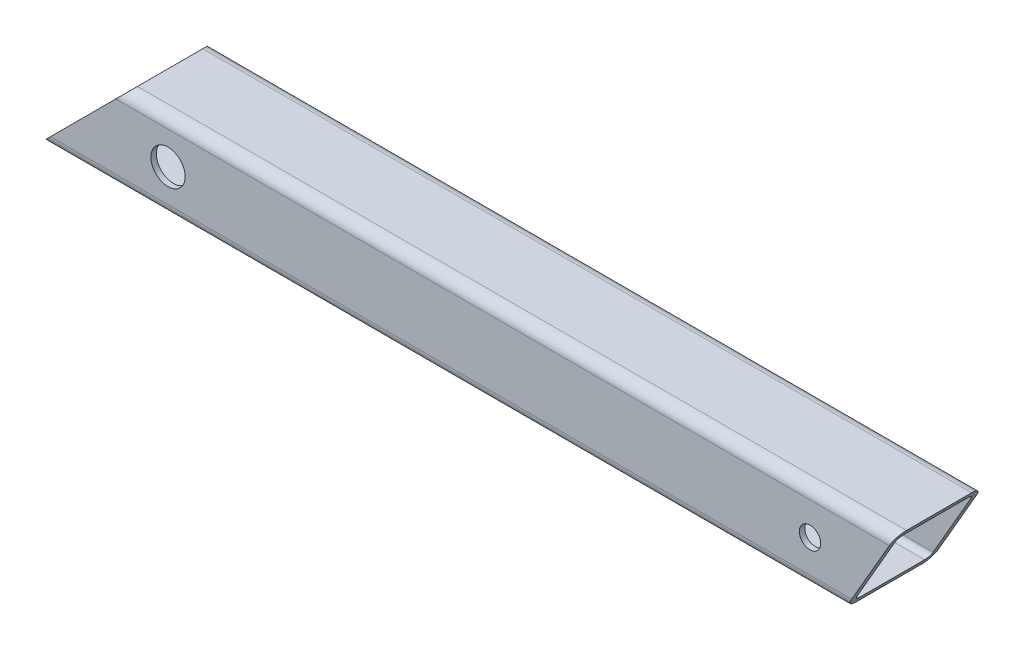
ISO-10303-21;
HEADER;
FILE_DESCRIPTION(('STEP AP214'),'2;1');
FILE_NAME('part.step','',(''),(''),'','','');
FILE_SCHEMA(('AUTOMOTIVE_DESIGN { 1 0 10303 214 1 1 1 1 }'));
ENDSEC;
DATA;
#1=APPLICATION_CONTEXT('core data for automotive mechanical design processes');
#2=APPLICATION_PROTOCOL_DEFINITION('international standard','automotive_design',2000,#1);
#3=PRODUCT_CONTEXT('',#1,'mechanical');
#4=PRODUCT('Part','Part','',(#3));
#5=PRODUCT_RELATED_PRODUCT_CATEGORY('part','',(#4));
#6=PRODUCT_DEFINITION_FORMATION('','',#4);
#7=PRODUCT_DEFINITION_CONTEXT('part definition',#1,'design');
#8=PRODUCT_DEFINITION('design','',#6,#7);
#9=PRODUCT_DEFINITION_SHAPE('','',#8);
#10=(LENGTH_UNIT() NAMED_UNIT(*) SI_UNIT(.MILLI.,.METRE.));
#11=(NAMED_UNIT(*) PLANE_ANGLE_UNIT() SI_UNIT($,.RADIAN.));
#12=(NAMED_UNIT(*) SI_UNIT($,.STERADIAN.) SOLID_ANGLE_UNIT());
#13=UNCERTAINTY_MEASURE_WITH_UNIT(LENGTH_MEASURE(1.E-05),#10,'distance_accuracy_value','');
#14=(GEOMETRIC_REPRESENTATION_CONTEXT(3) GLOBAL_UNCERTAINTY_ASSIGNED_CONTEXT((#13)) GLOBAL_UNIT_ASSIGNED_CONTEXT((#10,
#11,#12)) REPRESENTATION_CONTEXT('',''));
#15=CARTESIAN_POINT('',(0.,0.,0.));
#16=DIRECTION('',(0.,0.,1.));
#17=DIRECTION('',(1.,0.,0.));
#18=AXIS2_PLACEMENT_3D('',#15,#16,#17);
#19=CARTESIAN_POINT('',(1000.,38.1,38.0999999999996));
#20=DIRECTION('',(-1.,0.,0.));
#21=DIRECTION('',(0.,0.,1.));
#22=AXIS2_PLACEMENT_3D('',#19,#20,#21);
#23=CYLINDRICAL_SURFACE('',#22,6.34999999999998);
#24=DIRECTION('',(-1.,0.,0.));
#25=VECTOR('',#24,1.);
#26=CARTESIAN_POINT('',(1000.,44.45,38.0999999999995));
#27=LINE('',#26,#25);
#28=CARTESIAN_POINT('',(996.333825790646,44.45,38.0999999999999));
#29=VERTEX_POINT('',#28);
#30=CARTESIAN_POINT('',(95.2499999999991,44.45,38.1));
#31=VERTEX_POINT('',#30);
#32=EDGE_CURVE('E12',#29,#31,#27,.T.);
#33=ORIENTED_EDGE('',*,*,#32,.F.);
#34=CARTESIAN_POINT('',(992.667651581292,38.1,38.0999999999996));
#35=DIRECTION('',(0.866025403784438,-0.500000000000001,0.));
#36=DIRECTION('',(-0.500000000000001,-0.866025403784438,0.));
#37=AXIS2_PLACEMENT_3D('',#34,#35,#36);
#38=ELLIPSE('',#37,7.33234841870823,6.34999999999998);
#39=CARTESIAN_POINT('',(992.667651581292,38.1,44.4499999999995));
#40=VERTEX_POINT('',#39);
#41=EDGE_CURVE('E276',#29,#40,#38,.T.);
#42=ORIENTED_EDGE('',*,*,#41,.T.);
#43=DIRECTION('',(-1.,0.,0.));
#44=VECTOR('',#43,1.);
#45=CARTESIAN_POINT('',(1000.,38.1,44.4499999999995));
#46=LINE('',#45,#44);
#47=CARTESIAN_POINT('',(88.8999999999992,38.1,44.4499999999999));
#48=VERTEX_POINT('',#47);
#49=EDGE_CURVE('E212',#40,#48,#46,.T.);
#50=ORIENTED_EDGE('',*,*,#49,.T.);
#51=CARTESIAN_POINT('',(88.8999999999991,38.1,38.1));
#52=DIRECTION('',(-0.707106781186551,0.707106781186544,0.));
#53=DIRECTION('',(-0.707106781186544,-0.707106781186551,0.));
#54=AXIS2_PLACEMENT_3D('',#51,#52,#53);
#55=ELLIPSE('',#54,8.98025612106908,6.34999999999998);
#56=EDGE_CURVE('E309',#48,#31,#55,.T.);
#57=ORIENTED_EDGE('',*,*,#56,.T.);
#58=EDGE_LOOP('',(#33,#42,#50,#57));
#59=FACE_BOUND('',#58,.T.);
#60=ADVANCED_FACE('F64',(#59),#23,.F.);
#61=CARTESIAN_POINT('',(1000.,44.45,38.0999999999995));
#62=DIRECTION('',(0.,-1.,0.));
#63=DIRECTION('',(0.,0.,-1.));
#64=AXIS2_PLACEMENT_3D('',#61,#62,#63);
#65=PLANE('',#64);
#66=DIRECTION('',(-1.,0.,0.));
#67=VECTOR('',#66,1.);
#68=CARTESIAN_POINT('',(1000.,44.45,-38.1000000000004));
#69=LINE('',#68,#67);
#70=CARTESIAN_POINT('',(996.333825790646,44.45,-38.1000000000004));
#71=VERTEX_POINT('',#70);
#72=CARTESIAN_POINT('',(95.2499999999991,44.45,-38.1));
#73=VERTEX_POINT('',#72);
#74=EDGE_CURVE('E73',#71,#73,#69,.T.);
#75=ORIENTED_EDGE('',*,*,#74,.F.);
#76=DIRECTION('',(0.,0.,1.));
#77=VECTOR('',#76,1.);
#78=CARTESIAN_POINT('',(996.333825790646,44.45,38.0999999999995));
#79=LINE('',#78,#77);
#80=EDGE_CURVE('E273',#71,#29,#79,.T.);
#81=ORIENTED_EDGE('',*,*,#80,.T.);
#82=ORIENTED_EDGE('',*,*,#32,.T.);
#83=DIRECTION('',(0.,0.,-1.));
#84=VECTOR('',#83,1.);
#85=CARTESIAN_POINT('',(95.2499999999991,44.45,38.0999999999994));
#86=LINE('',#85,#84);
#87=EDGE_CURVE('E306',#31,#73,#86,.T.);
#88=ORIENTED_EDGE('',*,*,#87,.T.);
#89=EDGE_LOOP('',(#75,#81,#82,#88));
#90=FACE_BOUND('',#89,.T.);
#91=ADVANCED_FACE('F357',(#90),#65,.T.);
#92=CARTESIAN_POINT('',(1000.,38.1,-38.1000000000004));
#93=DIRECTION('',(-1.,0.,0.));
#94=DIRECTION('',(0.,0.,1.));
#95=AXIS2_PLACEMENT_3D('',#92,#93,#94);
#96=CYLINDRICAL_SURFACE('',#95,6.34999999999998);
#97=DIRECTION('',(-1.,0.,0.));
#98=VECTOR('',#97,1.);
#99=CARTESIAN_POINT('',(1000.,38.1,-44.4500000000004));
#100=LINE('',#99,#98);
#101=CARTESIAN_POINT('',(992.667651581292,38.1,-44.4500000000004));
#102=VERTEX_POINT('',#101);
#103=CARTESIAN_POINT('',(88.8999999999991,38.1,-44.45));
#104=VERTEX_POINT('',#103);
#105=EDGE_CURVE('E222',#102,#104,#100,.T.);
#106=ORIENTED_EDGE('',*,*,#105,.F.);
#107=CARTESIAN_POINT('',(992.667651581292,38.1,-38.1000000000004));
#108=DIRECTION('',(0.866025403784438,-0.500000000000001,0.));
#109=DIRECTION('',(-0.500000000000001,-0.866025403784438,0.));
#110=AXIS2_PLACEMENT_3D('',#107,#108,#109);
#111=ELLIPSE('',#110,7.33234841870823,6.34999999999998);
#112=EDGE_CURVE('E270',#102,#71,#111,.T.);
#113=ORIENTED_EDGE('',*,*,#112,.T.);
#114=ORIENTED_EDGE('',*,*,#74,.T.);
#115=CARTESIAN_POINT('',(88.8999999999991,38.1,-38.1));
#116=DIRECTION('',(-0.707106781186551,0.707106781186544,0.));
#117=DIRECTION('',(-0.707106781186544,-0.707106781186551,0.));
#118=AXIS2_PLACEMENT_3D('',#115,#116,#117);
#119=ELLIPSE('',#118,8.98025612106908,6.34999999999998);
#120=EDGE_CURVE('E303',#73,#104,#119,.T.);
#121=ORIENTED_EDGE('',*,*,#120,.T.);
#122=EDGE_LOOP('',(#106,#113,#114,#121));
#123=FACE_BOUND('',#122,.T.);
#124=ADVANCED_FACE('F363',(#123),#96,.F.);
#125=CARTESIAN_POINT('',(1000.,38.1,-44.4500000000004));
#126=DIRECTION('',(0.,0.,1.));
#127=DIRECTION('',(1.,0.,0.));
#128=AXIS2_PLACEMENT_3D('',#125,#126,#127);
#129=PLANE('',#128);
#130=CARTESIAN_POINT('',(900.,0.,-44.4500000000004));
#131=DIRECTION('',(0.,0.,1.));
#132=DIRECTION('',(1.,0.,0.));
#133=AXIS2_PLACEMENT_3D('',#130,#131,#132);
#134=CIRCLE('',#133,12.5);
#135=CARTESIAN_POINT('',(912.5,0.,-44.4500000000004));
#136=VERTEX_POINT('',#135);
#137=EDGE_CURVE('E248',#136,#136,#134,.T.);
#138=ORIENTED_EDGE('',*,*,#137,.F.);
#139=EDGE_LOOP('',(#138));
#140=FACE_BOUND('',#139,.T.);
#141=CARTESIAN_POINT('',(150.,0.,-44.45));
#142=DIRECTION('',(0.,0.,1.));
#143=DIRECTION('',(1.,0.,0.));
#144=AXIS2_PLACEMENT_3D('',#141,#142,#143);
#145=CIRCLE('',#144,20.);
#146=CARTESIAN_POINT('',(170.,0.,-44.45));
#147=VERTEX_POINT('',#146);
#148=EDGE_CURVE('E235',#147,#147,#145,.T.);
#149=ORIENTED_EDGE('',*,*,#148,.F.);
#150=EDGE_LOOP('',(#149));
#151=FACE_BOUND('',#150,.T.);
#152=DIRECTION('',(-1.,0.,0.));
#153=VECTOR('',#152,1.);
#154=CARTESIAN_POINT('',(1000.,-38.1,-44.4500000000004));
#155=LINE('',#154,#153);
#156=CARTESIAN_POINT('',(948.673561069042,-38.1,-44.4500000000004));
#157=VERTEX_POINT('',#156);
#158=CARTESIAN_POINT('',(12.6999999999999,-38.1,-44.45));
#159=VERTEX_POINT('',#158);
#160=EDGE_CURVE('E220',#157,#159,#155,.T.);
#161=ORIENTED_EDGE('',*,*,#160,.F.);
#162=DIRECTION('',(0.500000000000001,0.866025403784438,0.));
#163=VECTOR('',#162,1.);
#164=CARTESIAN_POINT('',(994.500738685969,41.275,-44.4500000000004));
#165=LINE('',#164,#163);
#166=EDGE_CURVE('E267',#157,#102,#165,.T.);
#167=ORIENTED_EDGE('',*,*,#166,.T.);
#168=ORIENTED_EDGE('',*,*,#105,.T.);
#169=DIRECTION('',(-0.707106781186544,-0.707106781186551,0.));
#170=VECTOR('',#169,1.);
#171=CARTESIAN_POINT('',(544.449999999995,493.650000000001,-44.45));
#172=LINE('',#171,#170);
#173=EDGE_CURVE('E300',#104,#159,#172,.T.);
#174=ORIENTED_EDGE('',*,*,#173,.T.);
#175=EDGE_LOOP('',(#161,#167,#168,#174));
#176=FACE_BOUND('',#175,.T.);
#177=ADVANCED_FACE('F400',(#140,#151,#176),#129,.T.);
#178=CARTESIAN_POINT('',(1000.,-38.1,-38.1000000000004));
#179=DIRECTION('',(-1.,0.,0.));
#180=DIRECTION('',(0.,0.,1.));
#181=AXIS2_PLACEMENT_3D('',#178,#179,#180);
#182=CYLINDRICAL_SURFACE('',#181,6.35);
#183=DIRECTION('',(-1.,0.,0.));
#184=VECTOR('',#183,1.);
#185=CARTESIAN_POINT('',(1000.,-44.45,-38.1000000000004));
#186=LINE('',#185,#184);
#187=CARTESIAN_POINT('',(945.007386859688,-44.45,-38.1000000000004));
#188=VERTEX_POINT('',#187);
#189=CARTESIAN_POINT('',(6.35000000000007,-44.45,-38.1000000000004));
#190=VERTEX_POINT('',#189);
#191=EDGE_CURVE('E218',#188,#190,#186,.T.);
#192=ORIENTED_EDGE('',*,*,#191,.F.);
#193=CARTESIAN_POINT('',(948.673561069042,-38.1,-38.1000000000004));
#194=DIRECTION('',(0.866025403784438,-0.500000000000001,0.));
#195=DIRECTION('',(-0.500000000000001,-0.866025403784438,0.));
#196=AXIS2_PLACEMENT_3D('',#193,#194,#195);
#197=ELLIPSE('',#196,7.33234841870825,6.35);
#198=EDGE_CURVE('E264',#188,#157,#197,.T.);
#199=ORIENTED_EDGE('',*,*,#198,.T.);
#200=ORIENTED_EDGE('',*,*,#160,.T.);
#201=CARTESIAN_POINT('',(12.6999999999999,-38.1,-38.1));
#202=DIRECTION('',(-0.707106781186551,0.707106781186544,0.));
#203=DIRECTION('',(-0.707106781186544,-0.707106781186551,0.));
#204=AXIS2_PLACEMENT_3D('',#201,#202,#203);
#205=ELLIPSE('',#204,8.9802561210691,6.35);
#206=EDGE_CURVE('E297',#159,#190,#205,.T.);
#207=ORIENTED_EDGE('',*,*,#206,.T.);
#208=EDGE_LOOP('',(#192,#199,#200,#207));
#209=FACE_BOUND('',#208,.T.);
#210=ADVANCED_FACE('F396',(#209),#182,.F.);
#211=CARTESIAN_POINT('',(1000.,-44.45,38.0999999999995));
#212=DIRECTION('',(0.,1.,0.));
#213=DIRECTION('',(0.,0.,1.));
#214=AXIS2_PLACEMENT_3D('',#211,#212,#213);
#215=PLANE('',#214);
#216=DIRECTION('',(-1.,0.,0.));
#217=VECTOR('',#216,1.);
#218=CARTESIAN_POINT('',(1000.,-44.45,38.0999999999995));
#219=LINE('',#218,#217);
#220=CARTESIAN_POINT('',(945.007386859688,-44.45,38.0999999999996));
#221=VERTEX_POINT('',#220);
#222=CARTESIAN_POINT('',(6.35000000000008,-44.45,38.1));
#223=VERTEX_POINT('',#222);
#224=EDGE_CURVE('E216',#221,#223,#219,.T.);
#225=ORIENTED_EDGE('',*,*,#224,.F.);
#226=DIRECTION('',(0.,0.,-1.));
#227=VECTOR('',#226,1.);
#228=CARTESIAN_POINT('',(945.007386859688,-44.45,38.0999999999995));
#229=LINE('',#228,#227);
#230=EDGE_CURVE('E261',#221,#188,#229,.T.);
#231=ORIENTED_EDGE('',*,*,#230,.T.);
#232=ORIENTED_EDGE('',*,*,#191,.T.);
#233=DIRECTION('',(0.,0.,1.));
#234=VECTOR('',#233,1.);
#235=CARTESIAN_POINT('',(6.35000000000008,-44.45,38.0999999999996));
#236=LINE('',#235,#234);
#237=EDGE_CURVE('E294',#190,#223,#236,.T.);
#238=ORIENTED_EDGE('',*,*,#237,.T.);
#239=EDGE_LOOP('',(#225,#231,#232,#238));
#240=FACE_BOUND('',#239,.T.);
#241=ADVANCED_FACE('F392',(#240),#215,.T.);
#242=CARTESIAN_POINT('',(1000.,-38.1,38.0999999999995));
#243=DIRECTION('',(-1.,0.,0.));
#244=DIRECTION('',(0.,0.,1.));
#245=AXIS2_PLACEMENT_3D('',#242,#243,#244);
#246=CYLINDRICAL_SURFACE('',#245,6.34999999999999);
#247=DIRECTION('',(-1.,0.,0.));
#248=VECTOR('',#247,1.);
#249=CARTESIAN_POINT('',(1000.,-38.1,44.4499999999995));
#250=LINE('',#249,#248);
#251=CARTESIAN_POINT('',(948.673561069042,-38.1,44.4499999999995));
#252=VERTEX_POINT('',#251);
#253=CARTESIAN_POINT('',(12.6999999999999,-38.0999999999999,44.4499999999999));
#254=VERTEX_POINT('',#253);
#255=EDGE_CURVE('E214',#252,#254,#250,.T.);
#256=ORIENTED_EDGE('',*,*,#255,.F.);
#257=CARTESIAN_POINT('',(948.673561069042,-38.1,38.0999999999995));
#258=DIRECTION('',(0.866025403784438,-0.500000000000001,0.));
#259=DIRECTION('',(-0.500000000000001,-0.866025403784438,0.));
#260=AXIS2_PLACEMENT_3D('',#257,#258,#259);
#261=ELLIPSE('',#260,7.33234841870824,6.34999999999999);
#262=EDGE_CURVE('E258',#252,#221,#261,.T.);
#263=ORIENTED_EDGE('',*,*,#262,.T.);
#264=ORIENTED_EDGE('',*,*,#224,.T.);
#265=CARTESIAN_POINT('',(12.6999999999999,-38.1,38.1));
#266=DIRECTION('',(-0.707106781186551,0.707106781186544,0.));
#267=DIRECTION('',(-0.707106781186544,-0.707106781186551,0.));
#268=AXIS2_PLACEMENT_3D('',#265,#266,#267);
#269=ELLIPSE('',#268,8.98025612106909,6.34999999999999);
#270=EDGE_CURVE('E291',#223,#254,#269,.T.);
#271=ORIENTED_EDGE('',*,*,#270,.T.);
#272=EDGE_LOOP('',(#256,#263,#264,#271));
#273=FACE_BOUND('',#272,.T.);
#274=ADVANCED_FACE('F389',(#273),#246,.F.);
#275=CARTESIAN_POINT('',(1000.,38.1,-38.1000000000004));
#276=DIRECTION('',(-1.,0.,0.));
#277=DIRECTION('',(0.,0.,1.));
#278=AXIS2_PLACEMENT_3D('',#275,#276,#277);
#279=CYLINDRICAL_SURFACE('',#278,12.7);
#280=CARTESIAN_POINT('',(992.667651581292,38.1,-38.1000000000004));
#281=DIRECTION('',(0.866025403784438,-0.500000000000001,0.));
#282=DIRECTION('',(-0.500000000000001,-0.866025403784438,0.));
#283=AXIS2_PLACEMENT_3D('',#280,#281,#282);
#284=ELLIPSE('',#283,14.6646968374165,12.7);
#285=CARTESIAN_POINT('',(992.667651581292,38.1,-50.8000000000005));
#286=VERTEX_POINT('',#285);
#287=CARTESIAN_POINT('',(1000.,50.8,-38.1000000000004));
#288=VERTEX_POINT('',#287);
#289=EDGE_CURVE('E200',#286,#288,#284,.T.);
#290=ORIENTED_EDGE('',*,*,#289,.F.);
#291=DIRECTION('',(-1.,0.,0.));
#292=VECTOR('',#291,1.);
#293=CARTESIAN_POINT('',(1000.,38.1,-50.8000000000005));
#294=LINE('',#293,#292);
#295=CARTESIAN_POINT('',(88.8999999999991,38.1,-50.8000000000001));
#296=VERTEX_POINT('',#295);
#297=EDGE_CURVE('E201',#286,#296,#294,.T.);
#298=ORIENTED_EDGE('',*,*,#297,.T.);
#299=CARTESIAN_POINT('',(88.8999999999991,38.1,-38.1));
#300=DIRECTION('',(-0.707106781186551,0.707106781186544,0.));
#301=DIRECTION('',(-0.707106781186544,-0.707106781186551,0.));
#302=AXIS2_PLACEMENT_3D('',#299,#300,#301);
#303=ELLIPSE('',#302,17.9605122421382,12.7);
#304=CARTESIAN_POINT('',(101.599999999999,50.8,-38.1000000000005));
#305=VERTEX_POINT('',#304);
#306=EDGE_CURVE('E318',#305,#296,#303,.T.);
#307=ORIENTED_EDGE('',*,*,#306,.F.);
#308=DIRECTION('',(-1.,0.,0.));
#309=VECTOR('',#308,1.);
#310=CARTESIAN_POINT('',(1000.,50.8,-38.1000000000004));
#311=LINE('',#310,#309);
#312=EDGE_CURVE('E189',#288,#305,#311,.T.);
#313=ORIENTED_EDGE('',*,*,#312,.F.);
#314=EDGE_LOOP('',(#290,#298,#307,#313));
#315=FACE_BOUND('',#314,.T.);
#316=ADVANCED_FACE('F66',(#315),#279,.T.);
#317=CARTESIAN_POINT('',(1000.,38.1,38.0999999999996));
#318=DIRECTION('',(-1.,0.,0.));
#319=DIRECTION('',(0.,0.,1.));
#320=AXIS2_PLACEMENT_3D('',#317,#318,#319);
#321=CYLINDRICAL_SURFACE('',#320,12.7);
#322=CARTESIAN_POINT('',(992.667651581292,38.1,38.0999999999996));
#323=DIRECTION('',(0.866025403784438,-0.500000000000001,0.));
#324=DIRECTION('',(-0.500000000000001,-0.866025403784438,0.));
#325=AXIS2_PLACEMENT_3D('',#322,#323,#324);
#326=ELLIPSE('',#325,14.6646968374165,12.7);
#327=CARTESIAN_POINT('',(1000.,50.8,38.0999999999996));
#328=VERTEX_POINT('',#327);
#329=CARTESIAN_POINT('',(992.667651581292,38.1,50.7999999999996));
#330=VERTEX_POINT('',#329);
#331=EDGE_CURVE('E193',#328,#330,#326,.T.);
#332=ORIENTED_EDGE('',*,*,#331,.F.);
#333=DIRECTION('',(-1.,0.,0.));
#334=VECTOR('',#333,1.);
#335=CARTESIAN_POINT('',(1000.,50.8,38.0999999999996));
#336=LINE('',#335,#334);
#337=CARTESIAN_POINT('',(101.599999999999,50.8,38.0999999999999));
#338=VERTEX_POINT('',#337);
#339=EDGE_CURVE('E179',#328,#338,#336,.T.);
#340=ORIENTED_EDGE('',*,*,#339,.T.);
#341=CARTESIAN_POINT('',(88.8999999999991,38.1,38.1));
#342=DIRECTION('',(-0.707106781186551,0.707106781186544,0.));
#343=DIRECTION('',(-0.707106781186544,-0.707106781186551,0.));
#344=AXIS2_PLACEMENT_3D('',#341,#342,#343);
#345=ELLIPSE('',#344,17.9605122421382,12.7);
#346=CARTESIAN_POINT('',(88.8999999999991,38.1,50.8));
#347=VERTEX_POINT('',#346);
#348=EDGE_CURVE('E207',#347,#338,#345,.T.);
#349=ORIENTED_EDGE('',*,*,#348,.F.);
#350=DIRECTION('',(-1.,0.,0.));
#351=VECTOR('',#350,1.);
#352=CARTESIAN_POINT('',(1000.,38.1,50.7999999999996));
#353=LINE('',#352,#351);
#354=EDGE_CURVE('E190',#330,#347,#353,.T.);
#355=ORIENTED_EDGE('',*,*,#354,.F.);
#356=EDGE_LOOP('',(#332,#340,#349,#355));
#357=FACE_BOUND('',#356,.T.);
#358=ADVANCED_FACE('F194',(#357),#321,.T.);
#359=CARTESIAN_POINT('',(1000.,38.1,50.7999999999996));
#360=DIRECTION('',(0.,0.,-1.));
#361=DIRECTION('',(-1.,0.,0.));
#362=AXIS2_PLACEMENT_3D('',#359,#360,#361);
#363=PLANE('',#362);
#364=CARTESIAN_POINT('',(900.,0.,50.8));
#365=DIRECTION('',(0.,0.,1.));
#366=DIRECTION('',(1.,0.,0.));
#367=AXIS2_PLACEMENT_3D('',#364,#365,#366);
#368=CIRCLE('',#367,12.5);
#369=CARTESIAN_POINT('',(912.5,0.,50.8));
#370=VERTEX_POINT('',#369);
#371=EDGE_CURVE('E449',#370,#370,#368,.T.);
#372=ORIENTED_EDGE('',*,*,#371,.F.);
#373=EDGE_LOOP('',(#372));
#374=FACE_BOUND('',#373,.T.);
#375=CARTESIAN_POINT('',(150.,0.,50.8));
#376=DIRECTION('',(0.,0.,1.));
#377=DIRECTION('',(1.,0.,0.));
#378=AXIS2_PLACEMENT_3D('',#375,#376,#377);
#379=CIRCLE('',#378,20.);
#380=CARTESIAN_POINT('',(170.,0.,50.8));
#381=VERTEX_POINT('',#380);
#382=EDGE_CURVE('E243',#381,#381,#379,.T.);
#383=ORIENTED_EDGE('',*,*,#382,.F.);
#384=EDGE_LOOP('',(#383));
#385=FACE_BOUND('',#384,.T.);
#386=DIRECTION('',(-0.500000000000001,-0.866025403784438,0.));
#387=VECTOR('',#386,1.);
#388=CARTESIAN_POINT('',(994.500738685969,41.275,50.7999999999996));
#389=LINE('',#388,#387);
#390=CARTESIAN_POINT('',(948.673561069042,-38.1,50.7999999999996));
#391=VERTEX_POINT('',#390);
#392=EDGE_CURVE('E81',#330,#391,#389,.T.);
#393=ORIENTED_EDGE('',*,*,#392,.F.);
#394=ORIENTED_EDGE('',*,*,#354,.T.);
#395=DIRECTION('',(0.707106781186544,0.707106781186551,0.));
#396=VECTOR('',#395,1.);
#397=CARTESIAN_POINT('',(544.449999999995,493.650000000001,50.8));
#398=LINE('',#397,#396);
#399=CARTESIAN_POINT('',(12.6999999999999,-38.1,50.8));
#400=VERTEX_POINT('',#399);
#401=EDGE_CURVE('E323',#400,#347,#398,.T.);
#402=ORIENTED_EDGE('',*,*,#401,.F.);
#403=DIRECTION('',(-1.,0.,0.));
#404=VECTOR('',#403,1.);
#405=CARTESIAN_POINT('',(1000.,-38.1,50.7999999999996));
#406=LINE('',#405,#404);
#407=EDGE_CURVE('E230',#391,#400,#406,.T.);
#408=ORIENTED_EDGE('',*,*,#407,.F.);
#409=EDGE_LOOP('',(#393,#394,#402,#408));
#410=FACE_BOUND('',#409,.T.);
#411=ADVANCED_FACE('F344',(#374,#385,#410),#363,.F.);
#412=CARTESIAN_POINT('',(1000.,-38.1,38.0999999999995));
#413=DIRECTION('',(-1.,0.,0.));
#414=DIRECTION('',(0.,0.,1.));
#415=AXIS2_PLACEMENT_3D('',#412,#413,#414);
#416=CYLINDRICAL_SURFACE('',#415,12.7);
#417=CARTESIAN_POINT('',(948.673561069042,-38.1,38.0999999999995));
#418=DIRECTION('',(0.866025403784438,-0.500000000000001,0.));
#419=DIRECTION('',(-0.500000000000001,-0.866025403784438,0.));
#420=AXIS2_PLACEMENT_3D('',#417,#418,#419);
#421=ELLIPSE('',#420,14.6646968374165,12.7);
#422=CARTESIAN_POINT('',(941.341212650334,-50.8,38.0999999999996));
#423=VERTEX_POINT('',#422);
#424=EDGE_CURVE('E89',#391,#423,#421,.T.);
#425=ORIENTED_EDGE('',*,*,#424,.F.);
#426=ORIENTED_EDGE('',*,*,#407,.T.);
#427=CARTESIAN_POINT('',(12.6999999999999,-38.1,38.1));
#428=DIRECTION('',(-0.707106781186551,0.707106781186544,0.));
#429=DIRECTION('',(-0.707106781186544,-0.707106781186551,0.));
#430=AXIS2_PLACEMENT_3D('',#427,#428,#429);
#431=ELLIPSE('',#430,17.9605122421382,12.7);
#432=CARTESIAN_POINT('',(0.,-50.8,38.1));
#433=VERTEX_POINT('',#432);
#434=EDGE_CURVE('E321',#433,#400,#431,.T.);
#435=ORIENTED_EDGE('',*,*,#434,.F.);
#436=DIRECTION('',(-1.,0.,0.));
#437=VECTOR('',#436,1.);
#438=CARTESIAN_POINT('',(1000.,-50.8,38.0999999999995));
#439=LINE('',#438,#437);
#440=EDGE_CURVE('E228',#423,#433,#439,.T.);
#441=ORIENTED_EDGE('',*,*,#440,.F.);
#442=EDGE_LOOP('',(#425,#426,#435,#441));
#443=FACE_BOUND('',#442,.T.);
#444=ADVANCED_FACE('F343',(#443),#416,.T.);
#445=CARTESIAN_POINT('',(1000.,-38.1,-38.1000000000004));
#446=DIRECTION('',(-1.,0.,0.));
#447=DIRECTION('',(0.,0.,1.));
#448=AXIS2_PLACEMENT_3D('',#445,#446,#447);
#449=CYLINDRICAL_SURFACE('',#448,12.7);
#450=CARTESIAN_POINT('',(948.673561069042,-38.1,-38.1000000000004));
#451=DIRECTION('',(0.866025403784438,-0.500000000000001,0.));
#452=DIRECTION('',(-0.500000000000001,-0.866025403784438,0.));
#453=AXIS2_PLACEMENT_3D('',#450,#451,#452);
#454=ELLIPSE('',#453,14.6646968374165,12.7);
#455=CARTESIAN_POINT('',(941.341212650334,-50.8,-38.1000000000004));
#456=VERTEX_POINT('',#455);
#457=CARTESIAN_POINT('',(948.673561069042,-38.1,-50.8000000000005));
#458=VERTEX_POINT('',#457);
#459=EDGE_CURVE('E281',#456,#458,#454,.T.);
#460=ORIENTED_EDGE('',*,*,#459,.F.);
#461=DIRECTION('',(-1.,0.,0.));
#462=VECTOR('',#461,1.);
#463=CARTESIAN_POINT('',(1000.,-50.8,-38.1000000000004));
#464=LINE('',#463,#462);
#465=CARTESIAN_POINT('',(0.,-50.8,-38.1));
#466=VERTEX_POINT('',#465);
#467=EDGE_CURVE('E226',#456,#466,#464,.T.);
#468=ORIENTED_EDGE('',*,*,#467,.T.);
#469=CARTESIAN_POINT('',(12.6999999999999,-38.1,-38.1));
#470=DIRECTION('',(-0.707106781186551,0.707106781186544,0.));
#471=DIRECTION('',(-0.707106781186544,-0.707106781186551,0.));
#472=AXIS2_PLACEMENT_3D('',#469,#470,#471);
#473=ELLIPSE('',#472,17.9605122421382,12.7);
#474=CARTESIAN_POINT('',(12.6999999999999,-38.1,-50.8));
#475=VERTEX_POINT('',#474);
#476=EDGE_CURVE('E315',#475,#466,#473,.T.);
#477=ORIENTED_EDGE('',*,*,#476,.F.);
#478=DIRECTION('',(-1.,0.,0.));
#479=VECTOR('',#478,1.);
#480=CARTESIAN_POINT('',(1000.,-38.1,-50.8000000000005));
#481=LINE('',#480,#479);
#482=EDGE_CURVE('E204',#458,#475,#481,.T.);
#483=ORIENTED_EDGE('',*,*,#482,.F.);
#484=EDGE_LOOP('',(#460,#468,#477,#483));
#485=FACE_BOUND('',#484,.T.);
#486=ADVANCED_FACE('F337',(#485),#449,.T.);
#487=CARTESIAN_POINT('',(1000.,38.1,-50.8000000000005));
#488=DIRECTION('',(0.,0.,1.));
#489=DIRECTION('',(1.,0.,0.));
#490=AXIS2_PLACEMENT_3D('',#487,#488,#489);
#491=PLANE('',#490);
#492=CARTESIAN_POINT('',(900.,0.,-50.8000000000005));
#493=DIRECTION('',(0.,0.,1.));
#494=DIRECTION('',(1.,0.,0.));
#495=AXIS2_PLACEMENT_3D('',#492,#493,#494);
#496=CIRCLE('',#495,12.5);
#497=CARTESIAN_POINT('',(912.5,0.,-50.8000000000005));
#498=VERTEX_POINT('',#497);
#499=EDGE_CURVE('E450',#498,#498,#496,.T.);
#500=ORIENTED_EDGE('',*,*,#499,.T.);
#501=EDGE_LOOP('',(#500));
#502=FACE_BOUND('',#501,.T.);
#503=CARTESIAN_POINT('',(150.,0.,-50.8000000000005));
#504=DIRECTION('',(0.,0.,1.));
#505=DIRECTION('',(1.,0.,0.));
#506=AXIS2_PLACEMENT_3D('',#503,#504,#505);
#507=CIRCLE('',#506,20.);
#508=CARTESIAN_POINT('',(170.,0.,-50.8000000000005));
#509=VERTEX_POINT('',#508);
#510=EDGE_CURVE('E236',#509,#509,#507,.T.);
#511=ORIENTED_EDGE('',*,*,#510,.T.);
#512=EDGE_LOOP('',(#511));
#513=FACE_BOUND('',#512,.T.);
#514=DIRECTION('',(0.500000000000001,0.866025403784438,0.));
#515=VECTOR('',#514,1.);
#516=CARTESIAN_POINT('',(994.500738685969,41.275,-50.8000000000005));
#517=LINE('',#516,#515);
#518=EDGE_CURVE('E279',#458,#286,#517,.T.);
#519=ORIENTED_EDGE('',*,*,#518,.F.);
#520=ORIENTED_EDGE('',*,*,#482,.T.);
#521=DIRECTION('',(-0.707106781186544,-0.707106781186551,0.));
#522=VECTOR('',#521,1.);
#523=CARTESIAN_POINT('',(544.449999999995,493.650000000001,-50.8000000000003));
#524=LINE('',#523,#522);
#525=EDGE_CURVE('E312',#296,#475,#524,.T.);
#526=ORIENTED_EDGE('',*,*,#525,.F.);
#527=ORIENTED_EDGE('',*,*,#297,.F.);
#528=EDGE_LOOP('',(#519,#520,#526,#527));
#529=FACE_BOUND('',#528,.T.);
#530=ADVANCED_FACE('F333',(#502,#513,#529),#491,.F.);
#531=CARTESIAN_POINT('',(1000.,38.1,44.4499999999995));
#532=DIRECTION('',(0.,0.,-1.));
#533=DIRECTION('',(-1.,0.,0.));
#534=AXIS2_PLACEMENT_3D('',#531,#532,#533);
#535=PLANE('',#534);
#536=CARTESIAN_POINT('',(900.,0.,44.4499999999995));
#537=DIRECTION('',(0.,0.,-1.));
#538=DIRECTION('',(-1.,0.,0.));
#539=AXIS2_PLACEMENT_3D('',#536,#537,#538);
#540=CIRCLE('',#539,12.5);
#541=CARTESIAN_POINT('',(887.5,0.,44.4499999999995));
#542=VERTEX_POINT('',#541);
#543=EDGE_CURVE('E68',#542,#542,#540,.T.);
#544=ORIENTED_EDGE('',*,*,#543,.F.);
#545=EDGE_LOOP('',(#544));
#546=FACE_BOUND('',#545,.T.);
#547=CARTESIAN_POINT('',(150.,0.,44.4499999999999));
#548=DIRECTION('',(0.,0.,-1.));
#549=DIRECTION('',(-1.,0.,0.));
#550=AXIS2_PLACEMENT_3D('',#547,#548,#549);
#551=CIRCLE('',#550,20.);
#552=CARTESIAN_POINT('',(130.,0.,44.4499999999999));
#553=VERTEX_POINT('',#552);
#554=EDGE_CURVE('E233',#553,#553,#551,.T.);
#555=ORIENTED_EDGE('',*,*,#554,.F.);
#556=EDGE_LOOP('',(#555));
#557=FACE_BOUND('',#556,.T.);
#558=ORIENTED_EDGE('',*,*,#49,.F.);
#559=DIRECTION('',(-0.500000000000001,-0.866025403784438,0.));
#560=VECTOR('',#559,1.);
#561=CARTESIAN_POINT('',(994.500738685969,41.275,44.4499999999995));
#562=LINE('',#561,#560);
#563=EDGE_CURVE('E255',#40,#252,#562,.T.);
#564=ORIENTED_EDGE('',*,*,#563,.T.);
#565=ORIENTED_EDGE('',*,*,#255,.T.);
#566=DIRECTION('',(0.707106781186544,0.707106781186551,0.));
#567=VECTOR('',#566,1.);
#568=CARTESIAN_POINT('',(544.449999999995,493.650000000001,44.4499999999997));
#569=LINE('',#568,#567);
#570=EDGE_CURVE('E288',#254,#48,#569,.T.);
#571=ORIENTED_EDGE('',*,*,#570,.T.);
#572=EDGE_LOOP('',(#558,#564,#565,#571));
#573=FACE_BOUND('',#572,.T.);
#574=ADVANCED_FACE('F371',(#546,#557,#573),#535,.T.);
#575=CARTESIAN_POINT('',(1000.,-50.8,38.0999999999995));
#576=DIRECTION('',(0.,1.,0.));
#577=DIRECTION('',(0.,0.,1.));
#578=AXIS2_PLACEMENT_3D('',#575,#576,#577);
#579=PLANE('',#578);
#580=DIRECTION('',(0.,0.,-1.));
#581=VECTOR('',#580,1.);
#582=CARTESIAN_POINT('',(941.341212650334,-50.8,1318.39978167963));
#583=LINE('',#582,#581);
#584=EDGE_CURVE('E240',#423,#456,#583,.T.);
#585=ORIENTED_EDGE('',*,*,#584,.F.);
#586=ORIENTED_EDGE('',*,*,#440,.T.);
#587=DIRECTION('',(0.,0.,-1.));
#588=VECTOR('',#587,1.);
#589=CARTESIAN_POINT('',(0.,-50.8,38.1));
#590=LINE('',#589,#588);
#591=EDGE_CURVE('E202',#433,#466,#590,.T.);
#592=ORIENTED_EDGE('',*,*,#591,.T.);
#593=ORIENTED_EDGE('',*,*,#467,.F.);
#594=EDGE_LOOP('',(#585,#586,#592,#593));
#595=FACE_BOUND('',#594,.T.);
#596=ADVANCED_FACE('F340',(#595),#579,.F.);
#597=CARTESIAN_POINT('',(1000.,50.8,38.0999999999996));
#598=DIRECTION('',(0.,-1.,0.));
#599=DIRECTION('',(0.,0.,-1.));
#600=AXIS2_PLACEMENT_3D('',#597,#598,#599);
#601=PLANE('',#600);
#602=DIRECTION('',(0.,0.,-1.));
#603=VECTOR('',#602,1.);
#604=CARTESIAN_POINT('',(101.599999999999,50.8,1310.46228167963));
#605=LINE('',#604,#603);
#606=EDGE_CURVE('E186',#338,#305,#605,.T.);
#607=ORIENTED_EDGE('',*,*,#606,.F.);
#608=ORIENTED_EDGE('',*,*,#339,.F.);
#609=DIRECTION('',(0.,0.,1.));
#610=VECTOR('',#609,1.);
#611=CARTESIAN_POINT('',(1000.,50.8,38.0999999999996));
#612=LINE('',#611,#610);
#613=EDGE_CURVE('E184',#288,#328,#612,.T.);
#614=ORIENTED_EDGE('',*,*,#613,.F.);
#615=ORIENTED_EDGE('',*,*,#312,.T.);
#616=EDGE_LOOP('',(#607,#608,#614,#615));
#617=FACE_BOUND('',#616,.T.);
#618=ADVANCED_FACE('F181',(#617),#601,.F.);
#619=CARTESIAN_POINT('',(0.,-50.8,1310.46228167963));
#620=DIRECTION('',(-0.707106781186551,0.707106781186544,0.));
#621=DIRECTION('',(-0.707106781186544,-0.707106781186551,0.));
#622=AXIS2_PLACEMENT_3D('',#619,#620,#621);
#623=PLANE('',#622);
#624=ORIENTED_EDGE('',*,*,#56,.F.);
#625=ORIENTED_EDGE('',*,*,#570,.F.);
#626=ORIENTED_EDGE('',*,*,#270,.F.);
#627=ORIENTED_EDGE('',*,*,#237,.F.);
#628=ORIENTED_EDGE('',*,*,#206,.F.);
#629=ORIENTED_EDGE('',*,*,#173,.F.);
#630=ORIENTED_EDGE('',*,*,#120,.F.);
#631=ORIENTED_EDGE('',*,*,#87,.F.);
#632=EDGE_LOOP('',(#624,#625,#626,#627,#628,#629,#630,#631));
#633=FACE_BOUND('',#632,.T.);
#634=ORIENTED_EDGE('',*,*,#401,.T.);
#635=ORIENTED_EDGE('',*,*,#348,.T.);
#636=ORIENTED_EDGE('',*,*,#606,.T.);
#637=ORIENTED_EDGE('',*,*,#306,.T.);
#638=ORIENTED_EDGE('',*,*,#525,.T.);
#639=ORIENTED_EDGE('',*,*,#476,.T.);
#640=ORIENTED_EDGE('',*,*,#591,.F.);
#641=ORIENTED_EDGE('',*,*,#434,.T.);
#642=EDGE_LOOP('',(#634,#635,#636,#637,#638,#639,#640,#641));
#643=FACE_BOUND('',#642,.T.);
#644=ADVANCED_FACE('F327',(#633,#643),#623,.T.);
#645=CARTESIAN_POINT('',(1000.,50.8,1318.39978167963));
#646=DIRECTION('',(0.866025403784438,-0.500000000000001,0.));
#647=DIRECTION('',(0.500000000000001,0.866025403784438,0.));
#648=AXIS2_PLACEMENT_3D('',#645,#646,#647);
#649=PLANE('',#648);
#650=ORIENTED_EDGE('',*,*,#41,.F.);
#651=ORIENTED_EDGE('',*,*,#80,.F.);
#652=ORIENTED_EDGE('',*,*,#112,.F.);
#653=ORIENTED_EDGE('',*,*,#166,.F.);
#654=ORIENTED_EDGE('',*,*,#198,.F.);
#655=ORIENTED_EDGE('',*,*,#230,.F.);
#656=ORIENTED_EDGE('',*,*,#262,.F.);
#657=ORIENTED_EDGE('',*,*,#563,.F.);
#658=EDGE_LOOP('',(#650,#651,#652,#653,#654,#655,#656,#657));
#659=FACE_BOUND('',#658,.T.);
#660=ORIENTED_EDGE('',*,*,#613,.T.);
#661=ORIENTED_EDGE('',*,*,#331,.T.);
#662=ORIENTED_EDGE('',*,*,#392,.T.);
#663=ORIENTED_EDGE('',*,*,#424,.T.);
#664=ORIENTED_EDGE('',*,*,#584,.T.);
#665=ORIENTED_EDGE('',*,*,#459,.T.);
#666=ORIENTED_EDGE('',*,*,#518,.T.);
#667=ORIENTED_EDGE('',*,*,#289,.T.);
#668=EDGE_LOOP('',(#660,#661,#662,#663,#664,#665,#666,#667));
#669=FACE_BOUND('',#668,.T.);
#670=ADVANCED_FACE('F198',(#659,#669),#649,.T.);
#671=CARTESIAN_POINT('',(150.,0.,-50.8000000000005));
#672=DIRECTION('',(0.,0.,1.));
#673=DIRECTION('',(1.,0.,0.));
#674=AXIS2_PLACEMENT_3D('',#671,#672,#673);
#675=CYLINDRICAL_SURFACE('',#674,20.);
#676=ORIENTED_EDGE('',*,*,#554,.T.);
#677=EDGE_LOOP('',(#676));
#678=FACE_BOUND('',#677,.T.);
#679=ORIENTED_EDGE('',*,*,#382,.T.);
#680=EDGE_LOOP('',(#679));
#681=FACE_BOUND('',#680,.T.);
#682=ADVANCED_FACE('F428',(#678,#681),#675,.F.);
#683=ORIENTED_EDGE('',*,*,#148,.T.);
#684=EDGE_LOOP('',(#683));
#685=FACE_BOUND('',#684,.T.);
#686=ORIENTED_EDGE('',*,*,#510,.F.);
#687=EDGE_LOOP('',(#686));
#688=FACE_BOUND('',#687,.T.);
#689=ADVANCED_FACE('F433',(#685,#688),#675,.F.);
#690=CARTESIAN_POINT('',(900.,0.,-50.8000000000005));
#691=DIRECTION('',(0.,0.,1.));
#692=DIRECTION('',(1.,0.,0.));
#693=AXIS2_PLACEMENT_3D('',#690,#691,#692);
#694=CYLINDRICAL_SURFACE('',#693,12.5);
#695=ORIENTED_EDGE('',*,*,#543,.T.);
#696=EDGE_LOOP('',(#695));
#697=FACE_BOUND('',#696,.T.);
#698=ORIENTED_EDGE('',*,*,#371,.T.);
#699=EDGE_LOOP('',(#698));
#700=FACE_BOUND('',#699,.T.);
#701=ADVANCED_FACE('F436',(#697,#700),#694,.F.);
#702=ORIENTED_EDGE('',*,*,#137,.T.);
#703=EDGE_LOOP('',(#702));
#704=FACE_BOUND('',#703,.T.);
#705=ORIENTED_EDGE('',*,*,#499,.F.);
#706=EDGE_LOOP('',(#705));
#707=FACE_BOUND('',#706,.T.);
#708=ADVANCED_FACE('F438',(#704,#707),#694,.F.);
#709=CLOSED_SHELL('',(#60,#91,#124,#177,#210,#241,#274,#316,#358,#411,#444,#486,#530,#574,#596,
#618,#644,#670,#682,#689,#701,#708));
#710=MANIFOLD_SOLID_BREP('B2',#709);
#711=ADVANCED_BREP_SHAPE_REPRESENTATION('',(#18,#710),#14);
#712=SHAPE_DEFINITION_REPRESENTATION(#9,#711);
ENDSEC;
END-ISO-10303-21;
